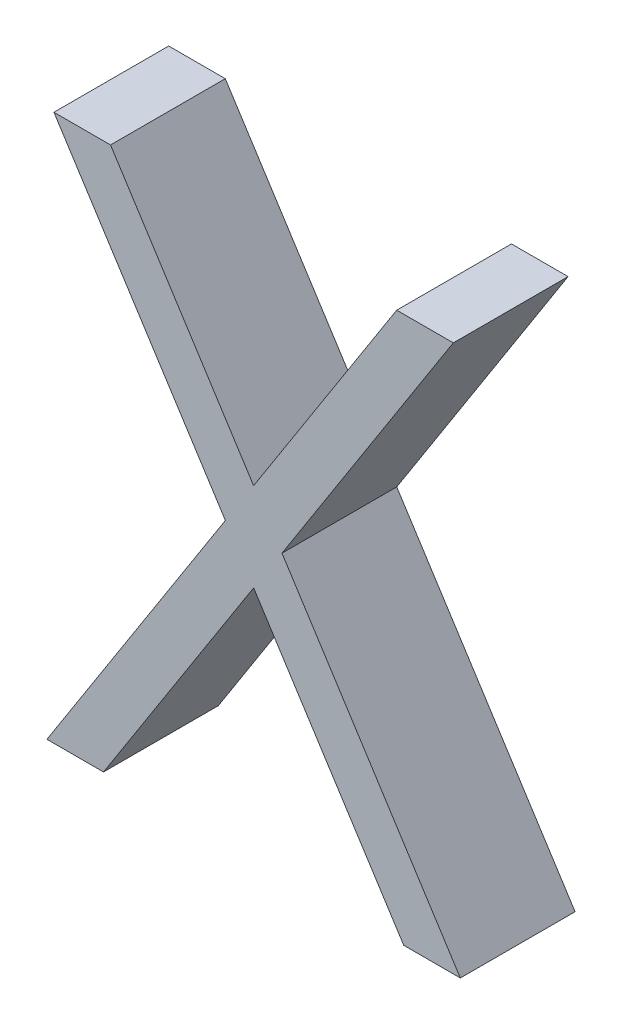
ISO-10303-21;
HEADER;
FILE_DESCRIPTION(('STEP AP214'),'2;1');
FILE_NAME('part.step','',(''),(''),'','','');
FILE_SCHEMA(('AUTOMOTIVE_DESIGN { 1 0 10303 214 1 1 1 1 }'));
ENDSEC;
DATA;
#1=APPLICATION_CONTEXT('core data for automotive mechanical design processes');
#2=APPLICATION_PROTOCOL_DEFINITION('international standard','automotive_design',2000,#1);
#3=PRODUCT_CONTEXT('',#1,'mechanical');
#4=PRODUCT('Part','Part','',(#3));
#5=PRODUCT_RELATED_PRODUCT_CATEGORY('part','',(#4));
#6=PRODUCT_DEFINITION_FORMATION('','',#4);
#7=PRODUCT_DEFINITION_CONTEXT('part definition',#1,'design');
#8=PRODUCT_DEFINITION('design','',#6,#7);
#9=PRODUCT_DEFINITION_SHAPE('','',#8);
#10=(LENGTH_UNIT() NAMED_UNIT(*) SI_UNIT(.MILLI.,.METRE.));
#11=(NAMED_UNIT(*) PLANE_ANGLE_UNIT() SI_UNIT($,.RADIAN.));
#12=(NAMED_UNIT(*) SI_UNIT($,.STERADIAN.) SOLID_ANGLE_UNIT());
#13=UNCERTAINTY_MEASURE_WITH_UNIT(LENGTH_MEASURE(1.E-05),#10,'distance_accuracy_value','');
#14=(GEOMETRIC_REPRESENTATION_CONTEXT(3) GLOBAL_UNCERTAINTY_ASSIGNED_CONTEXT((#13)) GLOBAL_UNIT_ASSIGNED_CONTEXT((#10,
#11,#12)) REPRESENTATION_CONTEXT('',''));
#15=CARTESIAN_POINT('',(0.,0.,0.));
#16=DIRECTION('',(0.,0.,1.));
#17=DIRECTION('',(1.,0.,0.));
#18=AXIS2_PLACEMENT_3D('',#15,#16,#17);
#19=CARTESIAN_POINT('',(150.585354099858,21.8711222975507,2.));
#20=DIRECTION('',(-0.842183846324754,-0.539190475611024,0.));
#21=DIRECTION('',(0.539190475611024,-0.842183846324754,0.));
#22=AXIS2_PLACEMENT_3D('',#19,#20,#21);
#23=PLANE('',#22);
#24=DIRECTION('',(-0.539190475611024,0.842183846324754,0.));
#25=VECTOR('',#24,1.);
#26=CARTESIAN_POINT('',(150.585354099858,21.8711222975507,-2.));
#27=LINE('',#26,#25);
#28=CARTESIAN_POINT('',(150.585354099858,21.8711222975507,-2.));
#29=VERTEX_POINT('',#28);
#30=CARTESIAN_POINT('',(144.609332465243,31.2053170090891,-2.));
#31=VERTEX_POINT('',#30);
#32=EDGE_CURVE('E152',#29,#31,#27,.T.);
#33=ORIENTED_EDGE('',*,*,#32,.F.);
#34=DIRECTION('',(0.,0.,-1.));
#35=VECTOR('',#34,1.);
#36=CARTESIAN_POINT('',(150.585354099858,21.8711222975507,2.));
#37=LINE('',#36,#35);
#38=CARTESIAN_POINT('',(150.585354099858,21.8711222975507,2.));
#39=VERTEX_POINT('',#38);
#40=EDGE_CURVE('E11',#39,#29,#37,.T.);
#41=ORIENTED_EDGE('',*,*,#40,.F.);
#42=DIRECTION('',(-0.539190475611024,0.842183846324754,0.));
#43=VECTOR('',#42,1.);
#44=CARTESIAN_POINT('',(150.585354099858,21.8711222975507,2.));
#45=LINE('',#44,#43);
#46=CARTESIAN_POINT('',(144.609332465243,31.2053170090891,2.));
#47=VERTEX_POINT('',#46);
#48=EDGE_CURVE('E184',#39,#47,#45,.T.);
#49=ORIENTED_EDGE('',*,*,#48,.T.);
#50=DIRECTION('',(0.,0.,-1.));
#51=VECTOR('',#50,1.);
#52=CARTESIAN_POINT('',(144.609332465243,31.2053170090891,2.));
#53=LINE('',#52,#51);
#54=EDGE_CURVE('E34',#47,#31,#53,.T.);
#55=ORIENTED_EDGE('',*,*,#54,.T.);
#56=EDGE_LOOP('',(#33,#41,#49,#55));
#57=FACE_BOUND('',#56,.T.);
#58=ADVANCED_FACE('F31',(#57),#23,.T.);
#59=CARTESIAN_POINT('',(144.365101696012,12.1553170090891,2.));
#60=DIRECTION('',(-0.842187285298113,0.53918510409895,0.));
#61=DIRECTION('',(-0.53918510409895,-0.842187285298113,0.));
#62=AXIS2_PLACEMENT_3D('',#59,#60,#61);
#63=PLANE('',#62);
#64=DIRECTION('',(0.53918510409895,0.842187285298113,0.));
#65=VECTOR('',#64,1.);
#66=CARTESIAN_POINT('',(144.365101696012,12.1553170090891,-2.));
#67=LINE('',#66,#65);
#68=CARTESIAN_POINT('',(144.365101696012,12.1553170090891,-2.));
#69=VERTEX_POINT('',#68);
#70=EDGE_CURVE('E182',#69,#29,#67,.T.);
#71=ORIENTED_EDGE('',*,*,#70,.F.);
#72=DIRECTION('',(0.,0.,-1.));
#73=VECTOR('',#72,1.);
#74=CARTESIAN_POINT('',(144.365101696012,12.1553170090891,2.));
#75=LINE('',#74,#73);
#76=CARTESIAN_POINT('',(144.365101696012,12.1553170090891,2.));
#77=VERTEX_POINT('',#76);
#78=EDGE_CURVE('E40',#77,#69,#75,.T.);
#79=ORIENTED_EDGE('',*,*,#78,.F.);
#80=DIRECTION('',(0.53918510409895,0.842187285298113,0.));
#81=VECTOR('',#80,1.);
#82=CARTESIAN_POINT('',(144.365101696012,12.1553170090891,2.));
#83=LINE('',#82,#81);
#84=EDGE_CURVE('E142',#77,#39,#83,.T.);
#85=ORIENTED_EDGE('',*,*,#84,.T.);
#86=ORIENTED_EDGE('',*,*,#40,.T.);
#87=EDGE_LOOP('',(#71,#79,#85,#86));
#88=FACE_BOUND('',#87,.T.);
#89=ADVANCED_FACE('F204',(#88),#63,.T.);
#90=CARTESIAN_POINT('',(146.338028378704,12.1553170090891,2.));
#91=DIRECTION('',(0.,-1.,0.));
#92=DIRECTION('',(0.,0.,-1.));
#93=AXIS2_PLACEMENT_3D('',#90,#91,#92);
#94=PLANE('',#93);
#95=DIRECTION('',(-1.,0.,0.));
#96=VECTOR('',#95,1.);
#97=CARTESIAN_POINT('',(146.338028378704,12.1553170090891,-2.));
#98=LINE('',#97,#96);
#99=CARTESIAN_POINT('',(146.338028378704,12.1553170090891,-2.));
#100=VERTEX_POINT('',#99);
#101=EDGE_CURVE('E129',#100,#69,#98,.T.);
#102=ORIENTED_EDGE('',*,*,#101,.F.);
#103=DIRECTION('',(0.,0.,-1.));
#104=VECTOR('',#103,1.);
#105=CARTESIAN_POINT('',(146.338028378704,12.1553170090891,2.));
#106=LINE('',#105,#104);
#107=CARTESIAN_POINT('',(146.338028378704,12.1553170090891,2.));
#108=VERTEX_POINT('',#107);
#109=EDGE_CURVE('E124',#108,#100,#106,.T.);
#110=ORIENTED_EDGE('',*,*,#109,.F.);
#111=DIRECTION('',(-1.,0.,0.));
#112=VECTOR('',#111,1.);
#113=CARTESIAN_POINT('',(146.338028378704,12.1553170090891,2.));
#114=LINE('',#113,#112);
#115=EDGE_CURVE('E127',#108,#77,#114,.T.);
#116=ORIENTED_EDGE('',*,*,#115,.T.);
#117=ORIENTED_EDGE('',*,*,#78,.T.);
#118=EDGE_LOOP('',(#102,#110,#116,#117));
#119=FACE_BOUND('',#118,.T.);
#120=ADVANCED_FACE('F126',(#119),#94,.T.);
#121=CARTESIAN_POINT('',(151.569909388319,20.3294155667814,2.));
#122=DIRECTION('',(0.842249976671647,-0.539087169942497,0.));
#123=DIRECTION('',(0.539087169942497,0.842249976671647,0.));
#124=AXIS2_PLACEMENT_3D('',#121,#122,#123);
#125=PLANE('',#124);
#126=DIRECTION('',(-0.539087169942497,-0.842249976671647,0.));
#127=VECTOR('',#126,1.);
#128=CARTESIAN_POINT('',(151.569909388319,20.3294155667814,-2.));
#129=LINE('',#128,#127);
#130=CARTESIAN_POINT('',(151.569909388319,20.3294155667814,-2.));
#131=VERTEX_POINT('',#130);
#132=EDGE_CURVE('E179',#131,#100,#129,.T.);
#133=ORIENTED_EDGE('',*,*,#132,.F.);
#134=DIRECTION('',(0.,0.,-1.));
#135=VECTOR('',#134,1.);
#136=CARTESIAN_POINT('',(151.569909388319,20.3294155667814,2.));
#137=LINE('',#136,#135);
#138=CARTESIAN_POINT('',(151.569909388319,20.3294155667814,2.));
#139=VERTEX_POINT('',#138);
#140=EDGE_CURVE('E134',#139,#131,#137,.T.);
#141=ORIENTED_EDGE('',*,*,#140,.F.);
#142=DIRECTION('',(-0.539087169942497,-0.842249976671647,0.));
#143=VECTOR('',#142,1.);
#144=CARTESIAN_POINT('',(151.569909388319,20.3294155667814,2.));
#145=LINE('',#144,#143);
#146=EDGE_CURVE('E140',#139,#108,#145,.T.);
#147=ORIENTED_EDGE('',*,*,#146,.T.);
#148=ORIENTED_EDGE('',*,*,#109,.T.);
#149=EDGE_LOOP('',(#133,#141,#147,#148));
#150=FACE_BOUND('',#149,.T.);
#151=ADVANCED_FACE('F144',(#150),#125,.T.);
#152=CARTESIAN_POINT('',(156.801790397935,12.1553170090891,2.));
#153=DIRECTION('',(-0.842249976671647,-0.539087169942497,0.));
#154=DIRECTION('',(0.539087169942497,-0.842249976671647,0.));
#155=AXIS2_PLACEMENT_3D('',#152,#153,#154);
#156=PLANE('',#155);
#157=DIRECTION('',(-0.539087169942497,0.842249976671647,0.));
#158=VECTOR('',#157,1.);
#159=CARTESIAN_POINT('',(156.801790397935,12.1553170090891,-2.));
#160=LINE('',#159,#158);
#161=CARTESIAN_POINT('',(156.801790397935,12.1553170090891,-2.));
#162=VERTEX_POINT('',#161);
#163=EDGE_CURVE('E176',#162,#131,#160,.T.);
#164=ORIENTED_EDGE('',*,*,#163,.F.);
#165=DIRECTION('',(0.,0.,-1.));
#166=VECTOR('',#165,1.);
#167=CARTESIAN_POINT('',(156.801790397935,12.1553170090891,2.));
#168=LINE('',#167,#166);
#169=CARTESIAN_POINT('',(156.801790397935,12.1553170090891,2.));
#170=VERTEX_POINT('',#169);
#171=EDGE_CURVE('E188',#170,#162,#168,.T.);
#172=ORIENTED_EDGE('',*,*,#171,.F.);
#173=DIRECTION('',(-0.539087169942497,0.842249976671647,0.));
#174=VECTOR('',#173,1.);
#175=CARTESIAN_POINT('',(156.801790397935,12.1553170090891,2.));
#176=LINE('',#175,#174);
#177=EDGE_CURVE('E145',#170,#139,#176,.T.);
#178=ORIENTED_EDGE('',*,*,#177,.T.);
#179=ORIENTED_EDGE('',*,*,#140,.T.);
#180=EDGE_LOOP('',(#164,#172,#178,#179));
#181=FACE_BOUND('',#180,.T.);
#182=ADVANCED_FACE('F217',(#181),#156,.T.);
#183=CARTESIAN_POINT('',(158.774717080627,12.1553170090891,2.));
#184=DIRECTION('',(0.,-1.,0.));
#185=DIRECTION('',(0.,0.,-1.));
#186=AXIS2_PLACEMENT_3D('',#183,#184,#185);
#187=PLANE('',#186);
#188=DIRECTION('',(-1.,0.,0.));
#189=VECTOR('',#188,1.);
#190=CARTESIAN_POINT('',(158.774717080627,12.1553170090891,-2.));
#191=LINE('',#190,#189);
#192=CARTESIAN_POINT('',(158.774717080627,12.1553170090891,-2.));
#193=VERTEX_POINT('',#192);
#194=EDGE_CURVE('E173',#193,#162,#191,.T.);
#195=ORIENTED_EDGE('',*,*,#194,.F.);
#196=DIRECTION('',(0.,0.,-1.));
#197=VECTOR('',#196,1.);
#198=CARTESIAN_POINT('',(158.774717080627,12.1553170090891,2.));
#199=LINE('',#198,#197);
#200=CARTESIAN_POINT('',(158.774717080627,12.1553170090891,2.));
#201=VERTEX_POINT('',#200);
#202=EDGE_CURVE('E190',#201,#193,#199,.T.);
#203=ORIENTED_EDGE('',*,*,#202,.F.);
#204=DIRECTION('',(-1.,0.,0.));
#205=VECTOR('',#204,1.);
#206=CARTESIAN_POINT('',(158.774717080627,12.1553170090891,2.));
#207=LINE('',#206,#205);
#208=EDGE_CURVE('E147',#201,#170,#207,.T.);
#209=ORIENTED_EDGE('',*,*,#208,.T.);
#210=ORIENTED_EDGE('',*,*,#171,.T.);
#211=EDGE_LOOP('',(#195,#203,#209,#210));
#212=FACE_BOUND('',#211,.T.);
#213=ADVANCED_FACE('F220',(#212),#187,.T.);
#214=CARTESIAN_POINT('',(152.55828078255,21.8711222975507,2.));
#215=DIRECTION('',(0.842337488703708,0.538950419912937,0.));
#216=DIRECTION('',(-0.538950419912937,0.842337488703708,0.));
#217=AXIS2_PLACEMENT_3D('',#214,#215,#216);
#218=PLANE('',#217);
#219=DIRECTION('',(0.538950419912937,-0.842337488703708,0.));
#220=VECTOR('',#219,1.);
#221=CARTESIAN_POINT('',(152.55828078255,21.8711222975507,-2.));
#222=LINE('',#221,#220);
#223=CARTESIAN_POINT('',(152.55828078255,21.8711222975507,-2.));
#224=VERTEX_POINT('',#223);
#225=EDGE_CURVE('E170',#224,#193,#222,.T.);
#226=ORIENTED_EDGE('',*,*,#225,.F.);
#227=DIRECTION('',(0.,0.,-1.));
#228=VECTOR('',#227,1.);
#229=CARTESIAN_POINT('',(152.55828078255,21.8711222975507,2.));
#230=LINE('',#229,#228);
#231=CARTESIAN_POINT('',(152.55828078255,21.8711222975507,2.));
#232=VERTEX_POINT('',#231);
#233=EDGE_CURVE('E192',#232,#224,#230,.T.);
#234=ORIENTED_EDGE('',*,*,#233,.F.);
#235=DIRECTION('',(0.538950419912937,-0.842337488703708,0.));
#236=VECTOR('',#235,1.);
#237=CARTESIAN_POINT('',(152.55828078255,21.8711222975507,2.));
#238=LINE('',#237,#236);
#239=EDGE_CURVE('E346',#232,#201,#238,.T.);
#240=ORIENTED_EDGE('',*,*,#239,.T.);
#241=ORIENTED_EDGE('',*,*,#202,.T.);
#242=EDGE_LOOP('',(#226,#234,#240,#241));
#243=FACE_BOUND('',#242,.T.);
#244=ADVANCED_FACE('F224',(#243),#218,.T.);
#245=CARTESIAN_POINT('',(158.530486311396,31.2053170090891,2.));
#246=DIRECTION('',(0.842340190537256,-0.538946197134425,0.));
#247=DIRECTION('',(0.538946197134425,0.842340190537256,0.));
#248=AXIS2_PLACEMENT_3D('',#245,#246,#247);
#249=PLANE('',#248);
#250=DIRECTION('',(-0.538946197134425,-0.842340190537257,0.));
#251=VECTOR('',#250,1.);
#252=CARTESIAN_POINT('',(158.530486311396,31.2053170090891,-2.));
#253=LINE('',#252,#251);
#254=CARTESIAN_POINT('',(158.530486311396,31.2053170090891,-2.));
#255=VERTEX_POINT('',#254);
#256=EDGE_CURVE('E167',#255,#224,#253,.T.);
#257=ORIENTED_EDGE('',*,*,#256,.F.);
#258=DIRECTION('',(0.,0.,-1.));
#259=VECTOR('',#258,1.);
#260=CARTESIAN_POINT('',(158.530486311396,31.2053170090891,2.));
#261=LINE('',#260,#259);
#262=CARTESIAN_POINT('',(158.530486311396,31.2053170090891,2.));
#263=VERTEX_POINT('',#262);
#264=EDGE_CURVE('E194',#263,#255,#261,.T.);
#265=ORIENTED_EDGE('',*,*,#264,.F.);
#266=DIRECTION('',(-0.538946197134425,-0.842340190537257,0.));
#267=VECTOR('',#266,1.);
#268=CARTESIAN_POINT('',(158.530486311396,31.2053170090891,2.));
#269=LINE('',#268,#267);
#270=EDGE_CURVE('E350',#263,#232,#269,.T.);
#271=ORIENTED_EDGE('',*,*,#270,.T.);
#272=ORIENTED_EDGE('',*,*,#233,.T.);
#273=EDGE_LOOP('',(#257,#265,#271,#272));
#274=FACE_BOUND('',#273,.T.);
#275=ADVANCED_FACE('F228',(#274),#249,.T.);
#276=CARTESIAN_POINT('',(156.557559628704,31.2053170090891,2.));
#277=DIRECTION('',(0.,1.,0.));
#278=DIRECTION('',(0.,0.,1.));
#279=AXIS2_PLACEMENT_3D('',#276,#277,#278);
#280=PLANE('',#279);
#281=DIRECTION('',(1.,0.,0.));
#282=VECTOR('',#281,1.);
#283=CARTESIAN_POINT('',(156.557559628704,31.2053170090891,-2.));
#284=LINE('',#283,#282);
#285=CARTESIAN_POINT('',(156.557559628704,31.2053170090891,-2.));
#286=VERTEX_POINT('',#285);
#287=EDGE_CURVE('E164',#286,#255,#284,.T.);
#288=ORIENTED_EDGE('',*,*,#287,.F.);
#289=DIRECTION('',(0.,0.,-1.));
#290=VECTOR('',#289,1.);
#291=CARTESIAN_POINT('',(156.557559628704,31.2053170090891,2.));
#292=LINE('',#291,#290);
#293=CARTESIAN_POINT('',(156.557559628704,31.2053170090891,2.));
#294=VERTEX_POINT('',#293);
#295=EDGE_CURVE('E196',#294,#286,#292,.T.);
#296=ORIENTED_EDGE('',*,*,#295,.F.);
#297=DIRECTION('',(1.,0.,0.));
#298=VECTOR('',#297,1.);
#299=CARTESIAN_POINT('',(156.557559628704,31.2053170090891,2.));
#300=LINE('',#299,#298);
#301=EDGE_CURVE('E339',#294,#263,#300,.T.);
#302=ORIENTED_EDGE('',*,*,#301,.T.);
#303=ORIENTED_EDGE('',*,*,#264,.T.);
#304=EDGE_LOOP('',(#288,#296,#302,#303));
#305=FACE_BOUND('',#304,.T.);
#306=ADVANCED_FACE('F232',(#305),#280,.T.);
#307=CARTESIAN_POINT('',(151.569909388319,23.4128290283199,2.));
#308=DIRECTION('',(-0.842248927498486,0.539088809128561,0.));
#309=DIRECTION('',(-0.539088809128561,-0.842248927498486,0.));
#310=AXIS2_PLACEMENT_3D('',#307,#308,#309);
#311=PLANE('',#310);
#312=DIRECTION('',(0.539088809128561,0.842248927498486,0.));
#313=VECTOR('',#312,1.);
#314=CARTESIAN_POINT('',(151.569909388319,23.4128290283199,-2.));
#315=LINE('',#314,#313);
#316=CARTESIAN_POINT('',(151.569909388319,23.4128290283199,-2.));
#317=VERTEX_POINT('',#316);
#318=EDGE_CURVE('E161',#317,#286,#315,.T.);
#319=ORIENTED_EDGE('',*,*,#318,.F.);
#320=DIRECTION('',(0.,0.,-1.));
#321=VECTOR('',#320,1.);
#322=CARTESIAN_POINT('',(151.569909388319,23.4128290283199,2.));
#323=LINE('',#322,#321);
#324=CARTESIAN_POINT('',(151.569909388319,23.4128290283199,2.));
#325=VERTEX_POINT('',#324);
#326=EDGE_CURVE('E198',#325,#317,#323,.T.);
#327=ORIENTED_EDGE('',*,*,#326,.F.);
#328=DIRECTION('',(0.539088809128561,0.842248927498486,0.));
#329=VECTOR('',#328,1.);
#330=CARTESIAN_POINT('',(151.569909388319,23.4128290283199,2.));
#331=LINE('',#330,#329);
#332=EDGE_CURVE('E335',#325,#294,#331,.T.);
#333=ORIENTED_EDGE('',*,*,#332,.T.);
#334=ORIENTED_EDGE('',*,*,#295,.T.);
#335=EDGE_LOOP('',(#319,#327,#333,#334));
#336=FACE_BOUND('',#335,.T.);
#337=ADVANCED_FACE('F236',(#336),#311,.T.);
#338=CARTESIAN_POINT('',(146.582259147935,31.2053170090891,2.));
#339=DIRECTION('',(0.842248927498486,0.539088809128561,0.));
#340=DIRECTION('',(-0.539088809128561,0.842248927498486,0.));
#341=AXIS2_PLACEMENT_3D('',#338,#339,#340);
#342=PLANE('',#341);
#343=DIRECTION('',(0.539088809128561,-0.842248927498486,0.));
#344=VECTOR('',#343,1.);
#345=CARTESIAN_POINT('',(146.582259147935,31.2053170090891,-2.));
#346=LINE('',#345,#344);
#347=CARTESIAN_POINT('',(146.582259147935,31.2053170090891,-2.));
#348=VERTEX_POINT('',#347);
#349=EDGE_CURVE('E158',#348,#317,#346,.T.);
#350=ORIENTED_EDGE('',*,*,#349,.F.);
#351=DIRECTION('',(0.,0.,-1.));
#352=VECTOR('',#351,1.);
#353=CARTESIAN_POINT('',(146.582259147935,31.2053170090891,2.));
#354=LINE('',#353,#352);
#355=CARTESIAN_POINT('',(146.582259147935,31.2053170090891,2.));
#356=VERTEX_POINT('',#355);
#357=EDGE_CURVE('E199',#356,#348,#354,.T.);
#358=ORIENTED_EDGE('',*,*,#357,.F.);
#359=DIRECTION('',(0.539088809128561,-0.842248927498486,0.));
#360=VECTOR('',#359,1.);
#361=CARTESIAN_POINT('',(146.582259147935,31.2053170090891,2.));
#362=LINE('',#361,#360);
#363=EDGE_CURVE('E356',#356,#325,#362,.T.);
#364=ORIENTED_EDGE('',*,*,#363,.T.);
#365=ORIENTED_EDGE('',*,*,#326,.T.);
#366=EDGE_LOOP('',(#350,#358,#364,#365));
#367=FACE_BOUND('',#366,.T.);
#368=ADVANCED_FACE('F240',(#367),#342,.T.);
#369=CARTESIAN_POINT('',(144.609332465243,31.2053170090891,2.));
#370=DIRECTION('',(0.,1.,0.));
#371=DIRECTION('',(0.,0.,1.));
#372=AXIS2_PLACEMENT_3D('',#369,#370,#371);
#373=PLANE('',#372);
#374=DIRECTION('',(1.,0.,0.));
#375=VECTOR('',#374,1.);
#376=CARTESIAN_POINT('',(144.609332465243,31.2053170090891,-2.));
#377=LINE('',#376,#375);
#378=EDGE_CURVE('E155',#31,#348,#377,.T.);
#379=ORIENTED_EDGE('',*,*,#378,.F.);
#380=ORIENTED_EDGE('',*,*,#54,.F.);
#381=DIRECTION('',(1.,0.,0.));
#382=VECTOR('',#381,1.);
#383=CARTESIAN_POINT('',(144.609332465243,31.2053170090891,2.));
#384=LINE('',#383,#382);
#385=EDGE_CURVE('E358',#47,#356,#384,.T.);
#386=ORIENTED_EDGE('',*,*,#385,.T.);
#387=ORIENTED_EDGE('',*,*,#357,.T.);
#388=EDGE_LOOP('',(#379,#380,#386,#387));
#389=FACE_BOUND('',#388,.T.);
#390=ADVANCED_FACE('F201',(#389),#373,.T.);
#391=CARTESIAN_POINT('',(150.585354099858,21.8711222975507,2.));
#392=DIRECTION('',(0.,0.,-1.));
#393=DIRECTION('',(-1.,0.,0.));
#394=AXIS2_PLACEMENT_3D('',#391,#392,#393);
#395=PLANE('',#394);
#396=ORIENTED_EDGE('',*,*,#48,.F.);
#397=ORIENTED_EDGE('',*,*,#84,.F.);
#398=ORIENTED_EDGE('',*,*,#115,.F.);
#399=ORIENTED_EDGE('',*,*,#146,.F.);
#400=ORIENTED_EDGE('',*,*,#177,.F.);
#401=ORIENTED_EDGE('',*,*,#208,.F.);
#402=ORIENTED_EDGE('',*,*,#239,.F.);
#403=ORIENTED_EDGE('',*,*,#270,.F.);
#404=ORIENTED_EDGE('',*,*,#301,.F.);
#405=ORIENTED_EDGE('',*,*,#332,.F.);
#406=ORIENTED_EDGE('',*,*,#363,.F.);
#407=ORIENTED_EDGE('',*,*,#385,.F.);
#408=EDGE_LOOP('',(#396,#397,#398,#399,#400,#401,#402,#403,#404,#405,#406,#407));
#409=FACE_BOUND('',#408,.T.);
#410=ADVANCED_FACE('F138',(#409),#395,.F.);
#411=CARTESIAN_POINT('',(150.585354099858,21.8711222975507,-2.));
#412=DIRECTION('',(0.,0.,-1.));
#413=DIRECTION('',(-1.,0.,0.));
#414=AXIS2_PLACEMENT_3D('',#411,#412,#413);
#415=PLANE('',#414);
#416=ORIENTED_EDGE('',*,*,#32,.T.);
#417=ORIENTED_EDGE('',*,*,#378,.T.);
#418=ORIENTED_EDGE('',*,*,#349,.T.);
#419=ORIENTED_EDGE('',*,*,#318,.T.);
#420=ORIENTED_EDGE('',*,*,#287,.T.);
#421=ORIENTED_EDGE('',*,*,#256,.T.);
#422=ORIENTED_EDGE('',*,*,#225,.T.);
#423=ORIENTED_EDGE('',*,*,#194,.T.);
#424=ORIENTED_EDGE('',*,*,#163,.T.);
#425=ORIENTED_EDGE('',*,*,#132,.T.);
#426=ORIENTED_EDGE('',*,*,#101,.T.);
#427=ORIENTED_EDGE('',*,*,#70,.T.);
#428=EDGE_LOOP('',(#416,#417,#418,#419,#420,#421,#422,#423,#424,#425,#426,#427));
#429=FACE_BOUND('',#428,.T.);
#430=ADVANCED_FACE('F203',(#429),#415,.T.);
#431=CLOSED_SHELL('',(#58,#89,#120,#151,#182,#213,#244,#275,#306,#337,#368,#390,#410,#430));
#432=MANIFOLD_SOLID_BREP('B2',#431);
#433=ADVANCED_BREP_SHAPE_REPRESENTATION('',(#18,#432),#14);
#434=SHAPE_DEFINITION_REPRESENTATION(#9,#433);
ENDSEC;
END-ISO-10303-21;
